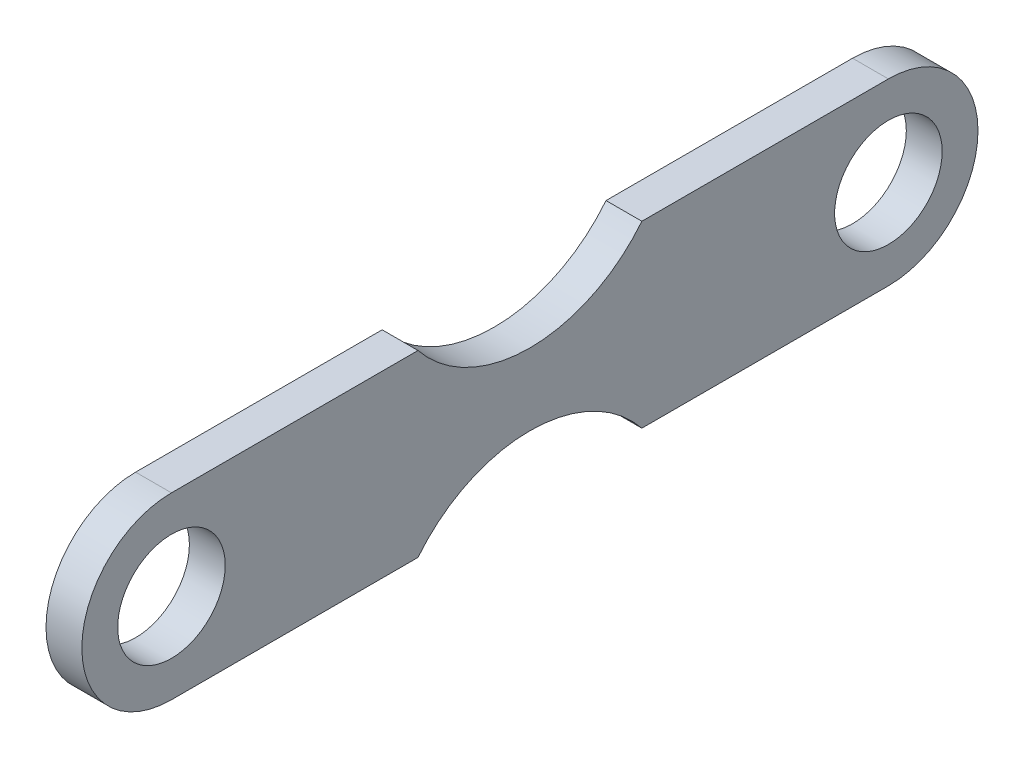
ISO-10303-21;
HEADER;
FILE_DESCRIPTION(('STEP AP214'),'2;1');
FILE_NAME('part.step','',(''),(''),'','','');
FILE_SCHEMA(('AUTOMOTIVE_DESIGN { 1 0 10303 214 1 1 1 1 }'));
ENDSEC;
DATA;
#1=APPLICATION_CONTEXT('core data for automotive mechanical design processes');
#2=APPLICATION_PROTOCOL_DEFINITION('international standard','automotive_design',2000,#1);
#3=PRODUCT_CONTEXT('',#1,'mechanical');
#4=PRODUCT('Part','Part','',(#3));
#5=PRODUCT_RELATED_PRODUCT_CATEGORY('part','',(#4));
#6=PRODUCT_DEFINITION_FORMATION('','',#4);
#7=PRODUCT_DEFINITION_CONTEXT('part definition',#1,'design');
#8=PRODUCT_DEFINITION('design','',#6,#7);
#9=PRODUCT_DEFINITION_SHAPE('','',#8);
#10=(LENGTH_UNIT() NAMED_UNIT(*) SI_UNIT(.MILLI.,.METRE.));
#11=(NAMED_UNIT(*) PLANE_ANGLE_UNIT() SI_UNIT($,.RADIAN.));
#12=(NAMED_UNIT(*) SI_UNIT($,.STERADIAN.) SOLID_ANGLE_UNIT());
#13=UNCERTAINTY_MEASURE_WITH_UNIT(LENGTH_MEASURE(1.E-05),#10,'distance_accuracy_value','');
#14=(GEOMETRIC_REPRESENTATION_CONTEXT(3) GLOBAL_UNCERTAINTY_ASSIGNED_CONTEXT((#13)) GLOBAL_UNIT_ASSIGNED_CONTEXT((#10,
#11,#12)) REPRESENTATION_CONTEXT('',''));
#15=CARTESIAN_POINT('',(0.,0.,0.));
#16=DIRECTION('',(0.,0.,1.));
#17=DIRECTION('',(1.,0.,0.));
#18=AXIS2_PLACEMENT_3D('',#15,#16,#17);
#19=CARTESIAN_POINT('',(10.,0.,-100.));
#20=DIRECTION('',(1.,0.,0.));
#21=DIRECTION('',(0.,0.,-1.));
#22=AXIS2_PLACEMENT_3D('',#19,#20,#21);
#23=PLANE('',#22);
#24=CARTESIAN_POINT('',(10.,0.,100.));
#25=DIRECTION('',(1.,0.,0.));
#26=DIRECTION('',(0.,0.,-1.));
#27=AXIS2_PLACEMENT_3D('',#24,#25,#26);
#28=CIRCLE('',#27,15.);
#29=CARTESIAN_POINT('',(10.,0.,85.));
#30=VERTEX_POINT('',#29);
#31=EDGE_CURVE('E134',#30,#30,#28,.T.);
#32=ORIENTED_EDGE('',*,*,#31,.F.);
#33=EDGE_LOOP('',(#32));
#34=FACE_BOUND('',#33,.T.);
#35=CARTESIAN_POINT('',(10.,0.,-100.));
#36=DIRECTION('',(1.,0.,0.));
#37=DIRECTION('',(0.,0.,-1.));
#38=AXIS2_PLACEMENT_3D('',#35,#36,#37);
#39=CIRCLE('',#38,25.);
#40=CARTESIAN_POINT('',(10.,-25.,-100.));
#41=VERTEX_POINT('',#40);
#42=CARTESIAN_POINT('',(10.,25.,-100.));
#43=VERTEX_POINT('',#42);
#44=EDGE_CURVE('E145',#41,#43,#39,.T.);
#45=ORIENTED_EDGE('',*,*,#44,.T.);
#46=DIRECTION('',(0.,0.,1.));
#47=VECTOR('',#46,1.);
#48=CARTESIAN_POINT('',(10.,25.,-100.));
#49=LINE('',#48,#47);
#50=CARTESIAN_POINT('',(10.,25.,-31.224989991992));
#51=VERTEX_POINT('',#50);
#52=EDGE_CURVE('E93',#43,#51,#49,.T.);
#53=ORIENTED_EDGE('',*,*,#52,.T.);
#54=CARTESIAN_POINT('',(10.,50.,0.));
#55=DIRECTION('',(-1.,0.,0.));
#56=DIRECTION('',(0.,0.,-1.));
#57=AXIS2_PLACEMENT_3D('',#54,#55,#56);
#58=CIRCLE('',#57,40.);
#59=CARTESIAN_POINT('',(10.,25.,31.224989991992));
#60=VERTEX_POINT('',#59);
#61=EDGE_CURVE('E160',#51,#60,#58,.T.);
#62=ORIENTED_EDGE('',*,*,#61,.T.);
#63=DIRECTION('',(0.,0.,1.));
#64=VECTOR('',#63,1.);
#65=CARTESIAN_POINT('',(10.,25.,31.224989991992));
#66=LINE('',#65,#64);
#67=CARTESIAN_POINT('',(10.,25.,100.));
#68=VERTEX_POINT('',#67);
#69=EDGE_CURVE('E173',#60,#68,#66,.T.);
#70=ORIENTED_EDGE('',*,*,#69,.T.);
#71=CARTESIAN_POINT('',(10.,0.,100.));
#72=DIRECTION('',(1.,0.,0.));
#73=DIRECTION('',(0.,0.,-1.));
#74=AXIS2_PLACEMENT_3D('',#71,#72,#73);
#75=CIRCLE('',#74,25.);
#76=CARTESIAN_POINT('',(10.,-25.,100.));
#77=VERTEX_POINT('',#76);
#78=EDGE_CURVE('E112',#68,#77,#75,.T.);
#79=ORIENTED_EDGE('',*,*,#78,.T.);
#80=DIRECTION('',(0.,0.,-1.));
#81=VECTOR('',#80,1.);
#82=CARTESIAN_POINT('',(10.,-25.,31.224989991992));
#83=LINE('',#82,#81);
#84=CARTESIAN_POINT('',(10.,-25.,31.224989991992));
#85=VERTEX_POINT('',#84);
#86=EDGE_CURVE('E106',#77,#85,#83,.T.);
#87=ORIENTED_EDGE('',*,*,#86,.T.);
#88=CARTESIAN_POINT('',(10.,-50.,0.));
#89=DIRECTION('',(-1.,0.,0.));
#90=DIRECTION('',(0.,0.,1.));
#91=AXIS2_PLACEMENT_3D('',#88,#89,#90);
#92=CIRCLE('',#91,40.);
#93=CARTESIAN_POINT('',(10.,-25.,-31.224989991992));
#94=VERTEX_POINT('',#93);
#95=EDGE_CURVE('E110',#85,#94,#92,.T.);
#96=ORIENTED_EDGE('',*,*,#95,.T.);
#97=DIRECTION('',(0.,0.,-1.));
#98=VECTOR('',#97,1.);
#99=CARTESIAN_POINT('',(10.,-25.,-100.));
#100=LINE('',#99,#98);
#101=EDGE_CURVE('E50',#94,#41,#100,.T.);
#102=ORIENTED_EDGE('',*,*,#101,.T.);
#103=EDGE_LOOP('',(#45,#53,#62,#70,#79,#87,#96,#102));
#104=FACE_BOUND('',#103,.T.);
#105=CARTESIAN_POINT('',(10.,0.,-100.));
#106=DIRECTION('',(1.,0.,0.));
#107=DIRECTION('',(0.,0.,-1.));
#108=AXIS2_PLACEMENT_3D('',#105,#106,#107);
#109=CIRCLE('',#108,15.);
#110=CARTESIAN_POINT('',(10.,0.,-115.));
#111=VERTEX_POINT('',#110);
#112=EDGE_CURVE('E182',#111,#111,#109,.T.);
#113=ORIENTED_EDGE('',*,*,#112,.F.);
#114=EDGE_LOOP('',(#113));
#115=FACE_BOUND('',#114,.T.);
#116=ADVANCED_FACE('F33',(#34,#104,#115),#23,.T.);
#117=CARTESIAN_POINT('',(0.,0.,-100.));
#118=DIRECTION('',(1.,0.,0.));
#119=DIRECTION('',(0.,0.,-1.));
#120=AXIS2_PLACEMENT_3D('',#117,#118,#119);
#121=PLANE('',#120);
#122=CARTESIAN_POINT('',(0.,0.,-100.));
#123=DIRECTION('',(1.,0.,0.));
#124=DIRECTION('',(0.,0.,-1.));
#125=AXIS2_PLACEMENT_3D('',#122,#123,#124);
#126=CIRCLE('',#125,25.);
#127=CARTESIAN_POINT('',(0.,-25.,-100.));
#128=VERTEX_POINT('',#127);
#129=CARTESIAN_POINT('',(0.,25.,-100.));
#130=VERTEX_POINT('',#129);
#131=EDGE_CURVE('E130',#128,#130,#126,.T.);
#132=ORIENTED_EDGE('',*,*,#131,.F.);
#133=DIRECTION('',(0.,0.,-1.));
#134=VECTOR('',#133,1.);
#135=CARTESIAN_POINT('',(0.,-25.,-100.));
#136=LINE('',#135,#134);
#137=CARTESIAN_POINT('',(0.,-25.,-31.224989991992));
#138=VERTEX_POINT('',#137);
#139=EDGE_CURVE('E85',#138,#128,#136,.T.);
#140=ORIENTED_EDGE('',*,*,#139,.F.);
#141=CARTESIAN_POINT('',(0.,-50.,0.));
#142=DIRECTION('',(-1.,0.,0.));
#143=DIRECTION('',(0.,0.,1.));
#144=AXIS2_PLACEMENT_3D('',#141,#142,#143);
#145=CIRCLE('',#144,40.);
#146=CARTESIAN_POINT('',(0.,-25.,31.224989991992));
#147=VERTEX_POINT('',#146);
#148=EDGE_CURVE('E79',#147,#138,#145,.T.);
#149=ORIENTED_EDGE('',*,*,#148,.F.);
#150=DIRECTION('',(0.,0.,-1.));
#151=VECTOR('',#150,1.);
#152=CARTESIAN_POINT('',(0.,-25.,31.224989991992));
#153=LINE('',#152,#151);
#154=CARTESIAN_POINT('',(0.,-25.,100.));
#155=VERTEX_POINT('',#154);
#156=EDGE_CURVE('E120',#155,#147,#153,.T.);
#157=ORIENTED_EDGE('',*,*,#156,.F.);
#158=CARTESIAN_POINT('',(0.,0.,100.));
#159=DIRECTION('',(1.,0.,0.));
#160=DIRECTION('',(0.,0.,-1.));
#161=AXIS2_PLACEMENT_3D('',#158,#159,#160);
#162=CIRCLE('',#161,25.);
#163=CARTESIAN_POINT('',(0.,25.,100.));
#164=VERTEX_POINT('',#163);
#165=EDGE_CURVE('E140',#164,#155,#162,.T.);
#166=ORIENTED_EDGE('',*,*,#165,.F.);
#167=DIRECTION('',(0.,0.,1.));
#168=VECTOR('',#167,1.);
#169=CARTESIAN_POINT('',(0.,25.,31.224989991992));
#170=LINE('',#169,#168);
#171=CARTESIAN_POINT('',(0.,25.,31.224989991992));
#172=VERTEX_POINT('',#171);
#173=EDGE_CURVE('E138',#172,#164,#170,.T.);
#174=ORIENTED_EDGE('',*,*,#173,.F.);
#175=CARTESIAN_POINT('',(0.,50.,0.));
#176=DIRECTION('',(-1.,0.,0.));
#177=DIRECTION('',(0.,0.,-1.));
#178=AXIS2_PLACEMENT_3D('',#175,#176,#177);
#179=CIRCLE('',#178,40.);
#180=CARTESIAN_POINT('',(0.,25.,-31.224989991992));
#181=VERTEX_POINT('',#180);
#182=EDGE_CURVE('E136',#181,#172,#179,.T.);
#183=ORIENTED_EDGE('',*,*,#182,.F.);
#184=DIRECTION('',(0.,0.,1.));
#185=VECTOR('',#184,1.);
#186=CARTESIAN_POINT('',(0.,25.,-100.));
#187=LINE('',#186,#185);
#188=EDGE_CURVE('E133',#130,#181,#187,.T.);
#189=ORIENTED_EDGE('',*,*,#188,.F.);
#190=EDGE_LOOP('',(#132,#140,#149,#157,#166,#174,#183,#189));
#191=FACE_BOUND('',#190,.T.);
#192=CARTESIAN_POINT('',(0.,0.,100.));
#193=DIRECTION('',(1.,0.,0.));
#194=DIRECTION('',(0.,0.,-1.));
#195=AXIS2_PLACEMENT_3D('',#192,#193,#194);
#196=CIRCLE('',#195,15.);
#197=CARTESIAN_POINT('',(0.,0.,85.));
#198=VERTEX_POINT('',#197);
#199=EDGE_CURVE('E179',#198,#198,#196,.T.);
#200=ORIENTED_EDGE('',*,*,#199,.T.);
#201=EDGE_LOOP('',(#200));
#202=FACE_BOUND('',#201,.T.);
#203=CARTESIAN_POINT('',(0.,0.,-100.));
#204=DIRECTION('',(1.,0.,0.));
#205=DIRECTION('',(0.,0.,-1.));
#206=AXIS2_PLACEMENT_3D('',#203,#204,#205);
#207=CIRCLE('',#206,15.);
#208=CARTESIAN_POINT('',(0.,0.,-115.));
#209=VERTEX_POINT('',#208);
#210=EDGE_CURVE('E185',#209,#209,#207,.T.);
#211=ORIENTED_EDGE('',*,*,#210,.T.);
#212=EDGE_LOOP('',(#211));
#213=FACE_BOUND('',#212,.T.);
#214=ADVANCED_FACE('F164',(#191,#202,#213),#121,.F.);
#215=CARTESIAN_POINT('',(10.,0.,-100.));
#216=DIRECTION('',(-1.,0.,0.));
#217=DIRECTION('',(0.,0.,1.));
#218=AXIS2_PLACEMENT_3D('',#215,#216,#217);
#219=CYLINDRICAL_SURFACE('',#218,25.);
#220=ORIENTED_EDGE('',*,*,#131,.T.);
#221=DIRECTION('',(-1.,0.,0.));
#222=VECTOR('',#221,1.);
#223=CARTESIAN_POINT('',(10.,25.,-100.));
#224=LINE('',#223,#222);
#225=EDGE_CURVE('E11',#43,#130,#224,.T.);
#226=ORIENTED_EDGE('',*,*,#225,.F.);
#227=ORIENTED_EDGE('',*,*,#44,.F.);
#228=DIRECTION('',(-1.,0.,0.));
#229=VECTOR('',#228,1.);
#230=CARTESIAN_POINT('',(10.,-25.,-100.));
#231=LINE('',#230,#229);
#232=EDGE_CURVE('E126',#41,#128,#231,.T.);
#233=ORIENTED_EDGE('',*,*,#232,.T.);
#234=EDGE_LOOP('',(#220,#226,#227,#233));
#235=FACE_BOUND('',#234,.T.);
#236=ADVANCED_FACE('F35',(#235),#219,.T.);
#237=CARTESIAN_POINT('',(10.,25.,-100.));
#238=DIRECTION('',(0.,-1.,0.));
#239=DIRECTION('',(0.,0.,-1.));
#240=AXIS2_PLACEMENT_3D('',#237,#238,#239);
#241=PLANE('',#240);
#242=ORIENTED_EDGE('',*,*,#188,.T.);
#243=DIRECTION('',(-1.,0.,0.));
#244=VECTOR('',#243,1.);
#245=CARTESIAN_POINT('',(10.,25.,-31.224989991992));
#246=LINE('',#245,#244);
#247=EDGE_CURVE('E42',#51,#181,#246,.T.);
#248=ORIENTED_EDGE('',*,*,#247,.F.);
#249=ORIENTED_EDGE('',*,*,#52,.F.);
#250=ORIENTED_EDGE('',*,*,#225,.T.);
#251=EDGE_LOOP('',(#242,#248,#249,#250));
#252=FACE_BOUND('',#251,.T.);
#253=ADVANCED_FACE('F217',(#252),#241,.F.);
#254=CARTESIAN_POINT('',(10.,50.,0.));
#255=DIRECTION('',(-1.,0.,0.));
#256=DIRECTION('',(0.,0.,1.));
#257=AXIS2_PLACEMENT_3D('',#254,#255,#256);
#258=CYLINDRICAL_SURFACE('',#257,40.);
#259=ORIENTED_EDGE('',*,*,#182,.T.);
#260=DIRECTION('',(-1.,0.,0.));
#261=VECTOR('',#260,1.);
#262=CARTESIAN_POINT('',(10.,25.,31.224989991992));
#263=LINE('',#262,#261);
#264=EDGE_CURVE('E152',#60,#172,#263,.T.);
#265=ORIENTED_EDGE('',*,*,#264,.F.);
#266=ORIENTED_EDGE('',*,*,#61,.F.);
#267=ORIENTED_EDGE('',*,*,#247,.T.);
#268=EDGE_LOOP('',(#259,#265,#266,#267));
#269=FACE_BOUND('',#268,.T.);
#270=ADVANCED_FACE('F158',(#269),#258,.F.);
#271=CARTESIAN_POINT('',(10.,25.,31.224989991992));
#272=DIRECTION('',(0.,-1.,0.));
#273=DIRECTION('',(0.,0.,-1.));
#274=AXIS2_PLACEMENT_3D('',#271,#272,#273);
#275=PLANE('',#274);
#276=ORIENTED_EDGE('',*,*,#173,.T.);
#277=DIRECTION('',(-1.,0.,0.));
#278=VECTOR('',#277,1.);
#279=CARTESIAN_POINT('',(10.,25.,100.));
#280=LINE('',#279,#278);
#281=EDGE_CURVE('E149',#68,#164,#280,.T.);
#282=ORIENTED_EDGE('',*,*,#281,.F.);
#283=ORIENTED_EDGE('',*,*,#69,.F.);
#284=ORIENTED_EDGE('',*,*,#264,.T.);
#285=EDGE_LOOP('',(#276,#282,#283,#284));
#286=FACE_BOUND('',#285,.T.);
#287=ADVANCED_FACE('F169',(#286),#275,.F.);
#288=CARTESIAN_POINT('',(10.,0.,100.));
#289=DIRECTION('',(-1.,0.,0.));
#290=DIRECTION('',(0.,0.,1.));
#291=AXIS2_PLACEMENT_3D('',#288,#289,#290);
#292=CYLINDRICAL_SURFACE('',#291,25.);
#293=ORIENTED_EDGE('',*,*,#165,.T.);
#294=DIRECTION('',(-1.,0.,0.));
#295=VECTOR('',#294,1.);
#296=CARTESIAN_POINT('',(10.,-25.,100.));
#297=LINE('',#296,#295);
#298=EDGE_CURVE('E121',#77,#155,#297,.T.);
#299=ORIENTED_EDGE('',*,*,#298,.F.);
#300=ORIENTED_EDGE('',*,*,#78,.F.);
#301=ORIENTED_EDGE('',*,*,#281,.T.);
#302=EDGE_LOOP('',(#293,#299,#300,#301));
#303=FACE_BOUND('',#302,.T.);
#304=ADVANCED_FACE('F172',(#303),#292,.T.);
#305=CARTESIAN_POINT('',(10.,-25.,31.224989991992));
#306=DIRECTION('',(0.,1.,0.));
#307=DIRECTION('',(0.,0.,1.));
#308=AXIS2_PLACEMENT_3D('',#305,#306,#307);
#309=PLANE('',#308);
#310=ORIENTED_EDGE('',*,*,#156,.T.);
#311=DIRECTION('',(-1.,0.,0.));
#312=VECTOR('',#311,1.);
#313=CARTESIAN_POINT('',(10.,-25.,31.224989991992));
#314=LINE('',#313,#312);
#315=EDGE_CURVE('E117',#85,#147,#314,.T.);
#316=ORIENTED_EDGE('',*,*,#315,.F.);
#317=ORIENTED_EDGE('',*,*,#86,.F.);
#318=ORIENTED_EDGE('',*,*,#298,.T.);
#319=EDGE_LOOP('',(#310,#316,#317,#318));
#320=FACE_BOUND('',#319,.T.);
#321=ADVANCED_FACE('F118',(#320),#309,.F.);
#322=CARTESIAN_POINT('',(10.,-50.,0.));
#323=DIRECTION('',(-1.,0.,0.));
#324=DIRECTION('',(0.,0.,1.));
#325=AXIS2_PLACEMENT_3D('',#322,#323,#324);
#326=CYLINDRICAL_SURFACE('',#325,40.);
#327=ORIENTED_EDGE('',*,*,#148,.T.);
#328=DIRECTION('',(-1.,0.,0.));
#329=VECTOR('',#328,1.);
#330=CARTESIAN_POINT('',(10.,-25.,-31.224989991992));
#331=LINE('',#330,#329);
#332=EDGE_CURVE('E122',#94,#138,#331,.T.);
#333=ORIENTED_EDGE('',*,*,#332,.F.);
#334=ORIENTED_EDGE('',*,*,#95,.F.);
#335=ORIENTED_EDGE('',*,*,#315,.T.);
#336=EDGE_LOOP('',(#327,#333,#334,#335));
#337=FACE_BOUND('',#336,.T.);
#338=ADVANCED_FACE('F124',(#337),#326,.F.);
#339=CARTESIAN_POINT('',(10.,-25.,-100.));
#340=DIRECTION('',(0.,1.,0.));
#341=DIRECTION('',(0.,0.,1.));
#342=AXIS2_PLACEMENT_3D('',#339,#340,#341);
#343=PLANE('',#342);
#344=ORIENTED_EDGE('',*,*,#139,.T.);
#345=ORIENTED_EDGE('',*,*,#232,.F.);
#346=ORIENTED_EDGE('',*,*,#101,.F.);
#347=ORIENTED_EDGE('',*,*,#332,.T.);
#348=EDGE_LOOP('',(#344,#345,#346,#347));
#349=FACE_BOUND('',#348,.T.);
#350=ADVANCED_FACE('F205',(#349),#343,.F.);
#351=CARTESIAN_POINT('',(10.,0.,100.));
#352=DIRECTION('',(-1.,0.,0.));
#353=DIRECTION('',(0.,0.,1.));
#354=AXIS2_PLACEMENT_3D('',#351,#352,#353);
#355=CYLINDRICAL_SURFACE('',#354,15.);
#356=ORIENTED_EDGE('',*,*,#31,.T.);
#357=EDGE_LOOP('',(#356));
#358=FACE_BOUND('',#357,.T.);
#359=ORIENTED_EDGE('',*,*,#199,.F.);
#360=EDGE_LOOP('',(#359));
#361=FACE_BOUND('',#360,.T.);
#362=ADVANCED_FACE('F202',(#358,#361),#355,.F.);
#363=CARTESIAN_POINT('',(10.,0.,-100.));
#364=DIRECTION('',(-1.,0.,0.));
#365=DIRECTION('',(0.,0.,1.));
#366=AXIS2_PLACEMENT_3D('',#363,#364,#365);
#367=CYLINDRICAL_SURFACE('',#366,15.);
#368=ORIENTED_EDGE('',*,*,#112,.T.);
#369=EDGE_LOOP('',(#368));
#370=FACE_BOUND('',#369,.T.);
#371=ORIENTED_EDGE('',*,*,#210,.F.);
#372=EDGE_LOOP('',(#371));
#373=FACE_BOUND('',#372,.T.);
#374=ADVANCED_FACE('F191',(#370,#373),#367,.F.);
#375=CLOSED_SHELL('',(#116,#214,#236,#253,#270,#287,#304,#321,#338,#350,#362,#374));
#376=MANIFOLD_SOLID_BREP('B2',#375);
#377=ADVANCED_BREP_SHAPE_REPRESENTATION('',(#18,#376),#14);
#378=SHAPE_DEFINITION_REPRESENTATION(#9,#377);
ENDSEC;
END-ISO-10303-21;
